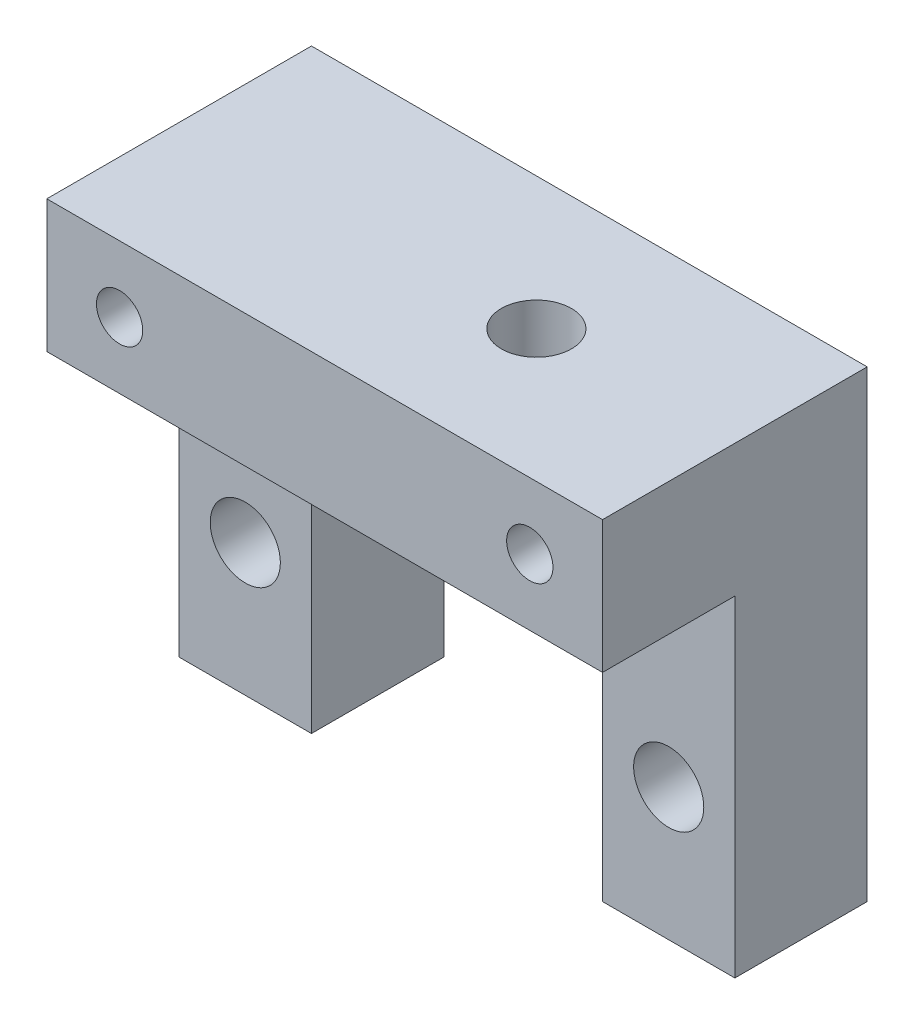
ISO-10303-21;
HEADER;
FILE_DESCRIPTION(('STEP AP214'),'2;1');
FILE_NAME('part.step','',(''),(''),'','','');
FILE_SCHEMA(('AUTOMOTIVE_DESIGN { 1 0 10303 214 1 1 1 1 }'));
ENDSEC;
DATA;
#1=APPLICATION_CONTEXT('core data for automotive mechanical design processes');
#2=APPLICATION_PROTOCOL_DEFINITION('international standard','automotive_design',2000,#1);
#3=PRODUCT_CONTEXT('',#1,'mechanical');
#4=PRODUCT('Part','Part','',(#3));
#5=PRODUCT_RELATED_PRODUCT_CATEGORY('part','',(#4));
#6=PRODUCT_DEFINITION_FORMATION('','',#4);
#7=PRODUCT_DEFINITION_CONTEXT('part definition',#1,'design');
#8=PRODUCT_DEFINITION('design','',#6,#7);
#9=PRODUCT_DEFINITION_SHAPE('','',#8);
#10=(LENGTH_UNIT() NAMED_UNIT(*) SI_UNIT(.MILLI.,.METRE.));
#11=(NAMED_UNIT(*) PLANE_ANGLE_UNIT() SI_UNIT($,.RADIAN.));
#12=(NAMED_UNIT(*) SI_UNIT($,.STERADIAN.) SOLID_ANGLE_UNIT());
#13=UNCERTAINTY_MEASURE_WITH_UNIT(LENGTH_MEASURE(1.E-05),#10,'distance_accuracy_value','');
#14=(GEOMETRIC_REPRESENTATION_CONTEXT(3) GLOBAL_UNCERTAINTY_ASSIGNED_CONTEXT((#13)) GLOBAL_UNIT_ASSIGNED_CONTEXT((#10,
#11,#12)) REPRESENTATION_CONTEXT('',''));
#15=CARTESIAN_POINT('',(0.,0.,0.));
#16=DIRECTION('',(0.,0.,1.));
#17=DIRECTION('',(1.,0.,0.));
#18=AXIS2_PLACEMENT_3D('',#15,#16,#17);
#19=CARTESIAN_POINT('',(0.,0.,0.));
#20=DIRECTION('',(0.,1.,0.));
#21=DIRECTION('',(0.,0.,1.));
#22=AXIS2_PLACEMENT_3D('',#19,#20,#21);
#23=PLANE('',#22);
#24=CARTESIAN_POINT('',(6.,0.,-0.550658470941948));
#25=DIRECTION('',(0.,1.,0.));
#26=DIRECTION('',(0.,0.,1.));
#27=AXIS2_PLACEMENT_3D('',#24,#25,#26);
#28=CIRCLE('',#27,2.65);
#29=CARTESIAN_POINT('',(6.,0.,2.09934152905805));
#30=VERTEX_POINT('',#29);
#31=EDGE_CURVE('E172',#30,#30,#28,.T.);
#32=ORIENTED_EDGE('',*,*,#31,.T.);
#33=EDGE_LOOP('',(#32));
#34=FACE_BOUND('',#33,.T.);
#35=DIRECTION('',(0.,0.,1.));
#36=VECTOR('',#35,1.);
#37=CARTESIAN_POINT('',(-11.,0.,-0.550658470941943));
#38=LINE('',#37,#36);
#39=CARTESIAN_POINT('',(-11.,0.,-10.5506584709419));
#40=VERTEX_POINT('',#39);
#41=CARTESIAN_POINT('',(-11.,0.,-0.550658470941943));
#42=VERTEX_POINT('',#41);
#43=EDGE_CURVE('E250',#40,#42,#38,.T.);
#44=ORIENTED_EDGE('',*,*,#43,.F.);
#45=DIRECTION('',(-1.,0.,0.));
#46=VECTOR('',#45,1.);
#47=CARTESIAN_POINT('',(21.,0.,-10.5506584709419));
#48=LINE('',#47,#46);
#49=CARTESIAN_POINT('',(11.,0.,-10.5506584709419));
#50=VERTEX_POINT('',#49);
#51=EDGE_CURVE('E55',#50,#40,#48,.T.);
#52=ORIENTED_EDGE('',*,*,#51,.F.);
#53=DIRECTION('',(0.,0.,-1.));
#54=VECTOR('',#53,1.);
#55=CARTESIAN_POINT('',(11.,0.,-0.550658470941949));
#56=LINE('',#55,#54);
#57=CARTESIAN_POINT('',(11.,0.,-0.550658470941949));
#58=VERTEX_POINT('',#57);
#59=EDGE_CURVE('E135',#58,#50,#56,.T.);
#60=ORIENTED_EDGE('',*,*,#59,.F.);
#61=DIRECTION('',(-1.,0.,0.));
#62=VECTOR('',#61,1.);
#63=CARTESIAN_POINT('',(21.,0.,-0.550658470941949));
#64=LINE('',#63,#62);
#65=CARTESIAN_POINT('',(21.,0.,-0.550658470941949));
#66=VERTEX_POINT('',#65);
#67=EDGE_CURVE('E49',#66,#58,#64,.T.);
#68=ORIENTED_EDGE('',*,*,#67,.F.);
#69=DIRECTION('',(0.,0.,-1.));
#70=VECTOR('',#69,1.);
#71=CARTESIAN_POINT('',(21.,0.,9.44934152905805));
#72=LINE('',#71,#70);
#73=CARTESIAN_POINT('',(21.,0.,9.44934152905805));
#74=VERTEX_POINT('',#73);
#75=EDGE_CURVE('E177',#74,#66,#72,.T.);
#76=ORIENTED_EDGE('',*,*,#75,.F.);
#77=DIRECTION('',(1.,0.,0.));
#78=VECTOR('',#77,1.);
#79=CARTESIAN_POINT('',(21.,0.,9.44934152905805));
#80=LINE('',#79,#78);
#81=CARTESIAN_POINT('',(-21.,0.,9.44934152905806));
#82=VERTEX_POINT('',#81);
#83=EDGE_CURVE('E180',#82,#74,#80,.T.);
#84=ORIENTED_EDGE('',*,*,#83,.F.);
#85=DIRECTION('',(0.,0.,1.));
#86=VECTOR('',#85,1.);
#87=CARTESIAN_POINT('',(-21.,0.,9.44934152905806));
#88=LINE('',#87,#86);
#89=CARTESIAN_POINT('',(-21.,0.,-0.550658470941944));
#90=VERTEX_POINT('',#89);
#91=EDGE_CURVE('E203',#90,#82,#88,.T.);
#92=ORIENTED_EDGE('',*,*,#91,.F.);
#93=DIRECTION('',(-1.,0.,0.));
#94=VECTOR('',#93,1.);
#95=CARTESIAN_POINT('',(-21.,0.,-0.550658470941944));
#96=LINE('',#95,#94);
#97=EDGE_CURVE('E130',#42,#90,#96,.T.);
#98=ORIENTED_EDGE('',*,*,#97,.F.);
#99=EDGE_LOOP('',(#44,#52,#60,#68,#76,#84,#92,#98));
#100=FACE_BOUND('',#99,.T.);
#101=ADVANCED_FACE('F32',(#34,#100),#23,.F.);
#102=CARTESIAN_POINT('',(-21.,10.,9.44934152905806));
#103=DIRECTION('',(1.,0.,0.));
#104=DIRECTION('',(0.,0.,-1.));
#105=AXIS2_PLACEMENT_3D('',#102,#103,#104);
#106=PLANE('',#105);
#107=DIRECTION('',(0.,-1.,0.));
#108=VECTOR('',#107,1.);
#109=CARTESIAN_POINT('',(-21.,10.,-10.5506584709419));
#110=LINE('',#109,#108);
#111=CARTESIAN_POINT('',(-21.,10.,-10.5506584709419));
#112=VERTEX_POINT('',#111);
#113=CARTESIAN_POINT('',(-21.,-25.,-10.5506584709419));
#114=VERTEX_POINT('',#113);
#115=EDGE_CURVE('E187',#112,#114,#110,.T.);
#116=ORIENTED_EDGE('',*,*,#115,.T.);
#117=DIRECTION('',(0.,0.,-1.));
#118=VECTOR('',#117,1.);
#119=CARTESIAN_POINT('',(-21.,-25.,-10.5506584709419));
#120=LINE('',#119,#118);
#121=CARTESIAN_POINT('',(-21.,-25.,-0.550658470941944));
#122=VERTEX_POINT('',#121);
#123=EDGE_CURVE('E127',#122,#114,#120,.T.);
#124=ORIENTED_EDGE('',*,*,#123,.F.);
#125=DIRECTION('',(0.,1.,0.));
#126=VECTOR('',#125,1.);
#127=CARTESIAN_POINT('',(-21.,-25.,-0.550658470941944));
#128=LINE('',#127,#126);
#129=EDGE_CURVE('E137',#122,#90,#128,.T.);
#130=ORIENTED_EDGE('',*,*,#129,.T.);
#131=ORIENTED_EDGE('',*,*,#91,.T.);
#132=DIRECTION('',(0.,-1.,0.));
#133=VECTOR('',#132,1.);
#134=CARTESIAN_POINT('',(-21.,10.,9.44934152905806));
#135=LINE('',#134,#133);
#136=CARTESIAN_POINT('',(-21.,10.,9.44934152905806));
#137=VERTEX_POINT('',#136);
#138=EDGE_CURVE('E11',#137,#82,#135,.T.);
#139=ORIENTED_EDGE('',*,*,#138,.F.);
#140=DIRECTION('',(0.,0.,1.));
#141=VECTOR('',#140,1.);
#142=CARTESIAN_POINT('',(-21.,10.,9.44934152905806));
#143=LINE('',#142,#141);
#144=EDGE_CURVE('E210',#112,#137,#143,.T.);
#145=ORIENTED_EDGE('',*,*,#144,.F.);
#146=EDGE_LOOP('',(#116,#124,#130,#131,#139,#145));
#147=FACE_BOUND('',#146,.T.);
#148=ADVANCED_FACE('F34',(#147),#106,.F.);
#149=CARTESIAN_POINT('',(21.,10.,9.44934152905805));
#150=DIRECTION('',(0.,0.,-1.));
#151=DIRECTION('',(-1.,0.,0.));
#152=AXIS2_PLACEMENT_3D('',#149,#150,#151);
#153=PLANE('',#152);
#154=CARTESIAN_POINT('',(15.5,5.,9.44934152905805));
#155=DIRECTION('',(0.,0.,1.));
#156=DIRECTION('',(1.,0.,0.));
#157=AXIS2_PLACEMENT_3D('',#154,#155,#156);
#158=CIRCLE('',#157,1.75);
#159=CARTESIAN_POINT('',(17.25,5.,9.44934152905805));
#160=VERTEX_POINT('',#159);
#161=EDGE_CURVE('E225',#160,#160,#158,.T.);
#162=ORIENTED_EDGE('',*,*,#161,.F.);
#163=EDGE_LOOP('',(#162));
#164=FACE_BOUND('',#163,.T.);
#165=CARTESIAN_POINT('',(-15.5,4.99999999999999,9.44934152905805));
#166=DIRECTION('',(0.,0.,1.));
#167=DIRECTION('',(1.,0.,0.));
#168=AXIS2_PLACEMENT_3D('',#165,#166,#167);
#169=CIRCLE('',#168,1.75);
#170=CARTESIAN_POINT('',(-13.75,4.99999999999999,9.44934152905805));
#171=VERTEX_POINT('',#170);
#172=EDGE_CURVE('E215',#171,#171,#169,.T.);
#173=ORIENTED_EDGE('',*,*,#172,.F.);
#174=EDGE_LOOP('',(#173));
#175=FACE_BOUND('',#174,.T.);
#176=ORIENTED_EDGE('',*,*,#83,.T.);
#177=DIRECTION('',(0.,-1.,0.));
#178=VECTOR('',#177,1.);
#179=CARTESIAN_POINT('',(21.,10.,9.44934152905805));
#180=LINE('',#179,#178);
#181=CARTESIAN_POINT('',(21.,10.,9.44934152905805));
#182=VERTEX_POINT('',#181);
#183=EDGE_CURVE('E41',#182,#74,#180,.T.);
#184=ORIENTED_EDGE('',*,*,#183,.F.);
#185=DIRECTION('',(1.,0.,0.));
#186=VECTOR('',#185,1.);
#187=CARTESIAN_POINT('',(21.,10.,9.44934152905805));
#188=LINE('',#187,#186);
#189=EDGE_CURVE('E206',#137,#182,#188,.T.);
#190=ORIENTED_EDGE('',*,*,#189,.F.);
#191=ORIENTED_EDGE('',*,*,#138,.T.);
#192=EDGE_LOOP('',(#176,#184,#190,#191));
#193=FACE_BOUND('',#192,.T.);
#194=ADVANCED_FACE('F205',(#164,#175,#193),#153,.F.);
#195=CARTESIAN_POINT('',(21.,10.,9.44934152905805));
#196=DIRECTION('',(-1.,0.,0.));
#197=DIRECTION('',(0.,0.,1.));
#198=AXIS2_PLACEMENT_3D('',#195,#196,#197);
#199=PLANE('',#198);
#200=ORIENTED_EDGE('',*,*,#75,.T.);
#201=DIRECTION('',(0.,1.,0.));
#202=VECTOR('',#201,1.);
#203=CARTESIAN_POINT('',(21.,-25.,-0.550658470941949));
#204=LINE('',#203,#202);
#205=CARTESIAN_POINT('',(21.,-25.,-0.550658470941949));
#206=VERTEX_POINT('',#205);
#207=EDGE_CURVE('E163',#206,#66,#204,.T.);
#208=ORIENTED_EDGE('',*,*,#207,.F.);
#209=DIRECTION('',(0.,0.,1.));
#210=VECTOR('',#209,1.);
#211=CARTESIAN_POINT('',(21.,-25.,-10.5506584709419));
#212=LINE('',#211,#210);
#213=CARTESIAN_POINT('',(21.,-25.,-10.5506584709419));
#214=VERTEX_POINT('',#213);
#215=EDGE_CURVE('E141',#214,#206,#212,.T.);
#216=ORIENTED_EDGE('',*,*,#215,.F.);
#217=DIRECTION('',(0.,-1.,0.));
#218=VECTOR('',#217,1.);
#219=CARTESIAN_POINT('',(21.,10.,-10.5506584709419));
#220=LINE('',#219,#218);
#221=CARTESIAN_POINT('',(21.,10.,-10.5506584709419));
#222=VERTEX_POINT('',#221);
#223=EDGE_CURVE('E189',#222,#214,#220,.T.);
#224=ORIENTED_EDGE('',*,*,#223,.F.);
#225=DIRECTION('',(0.,0.,-1.));
#226=VECTOR('',#225,1.);
#227=CARTESIAN_POINT('',(21.,10.,9.44934152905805));
#228=LINE('',#227,#226);
#229=EDGE_CURVE('E198',#182,#222,#228,.T.);
#230=ORIENTED_EDGE('',*,*,#229,.F.);
#231=ORIENTED_EDGE('',*,*,#183,.T.);
#232=EDGE_LOOP('',(#200,#208,#216,#224,#230,#231));
#233=FACE_BOUND('',#232,.T.);
#234=ADVANCED_FACE('F196',(#233),#199,.F.);
#235=CARTESIAN_POINT('',(21.,10.,-10.5506584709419));
#236=DIRECTION('',(0.,0.,1.));
#237=DIRECTION('',(1.,0.,0.));
#238=AXIS2_PLACEMENT_3D('',#235,#236,#237);
#239=PLANE('',#238);
#240=CARTESIAN_POINT('',(-16.,-15.,-10.5506584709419));
#241=DIRECTION('',(0.,0.,1.));
#242=DIRECTION('',(1.,0.,0.));
#243=AXIS2_PLACEMENT_3D('',#240,#241,#242);
#244=CIRCLE('',#243,2.65);
#245=CARTESIAN_POINT('',(-13.35,-15.,-10.5506584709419));
#246=VERTEX_POINT('',#245);
#247=EDGE_CURVE('E362',#246,#246,#244,.T.);
#248=ORIENTED_EDGE('',*,*,#247,.T.);
#249=EDGE_LOOP('',(#248));
#250=FACE_BOUND('',#249,.T.);
#251=CARTESIAN_POINT('',(16.,-15.,-10.5506584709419));
#252=DIRECTION('',(0.,0.,1.));
#253=DIRECTION('',(1.,0.,0.));
#254=AXIS2_PLACEMENT_3D('',#251,#252,#253);
#255=CIRCLE('',#254,2.65);
#256=CARTESIAN_POINT('',(18.65,-15.,-10.5506584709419));
#257=VERTEX_POINT('',#256);
#258=EDGE_CURVE('E252',#257,#257,#255,.T.);
#259=ORIENTED_EDGE('',*,*,#258,.T.);
#260=EDGE_LOOP('',(#259));
#261=FACE_BOUND('',#260,.T.);
#262=CARTESIAN_POINT('',(15.5,5.,-10.5506584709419));
#263=DIRECTION('',(0.,0.,1.));
#264=DIRECTION('',(1.,0.,0.));
#265=AXIS2_PLACEMENT_3D('',#262,#263,#264);
#266=CIRCLE('',#265,1.75);
#267=CARTESIAN_POINT('',(17.25,5.,-10.5506584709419));
#268=VERTEX_POINT('',#267);
#269=EDGE_CURVE('E223',#268,#268,#266,.T.);
#270=ORIENTED_EDGE('',*,*,#269,.T.);
#271=EDGE_LOOP('',(#270));
#272=FACE_BOUND('',#271,.T.);
#273=CARTESIAN_POINT('',(-15.5,4.99999999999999,-10.5506584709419));
#274=DIRECTION('',(0.,0.,1.));
#275=DIRECTION('',(1.,0.,0.));
#276=AXIS2_PLACEMENT_3D('',#273,#274,#275);
#277=CIRCLE('',#276,1.75);
#278=CARTESIAN_POINT('',(-13.75,4.99999999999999,-10.5506584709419));
#279=VERTEX_POINT('',#278);
#280=EDGE_CURVE('E213',#279,#279,#277,.T.);
#281=ORIENTED_EDGE('',*,*,#280,.T.);
#282=EDGE_LOOP('',(#281));
#283=FACE_BOUND('',#282,.T.);
#284=ORIENTED_EDGE('',*,*,#223,.T.);
#285=DIRECTION('',(1.,0.,0.));
#286=VECTOR('',#285,1.);
#287=CARTESIAN_POINT('',(11.,-25.,-10.5506584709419));
#288=LINE('',#287,#286);
#289=CARTESIAN_POINT('',(11.,-25.,-10.5506584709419));
#290=VERTEX_POINT('',#289);
#291=EDGE_CURVE('E148',#290,#214,#288,.T.);
#292=ORIENTED_EDGE('',*,*,#291,.F.);
#293=DIRECTION('',(0.,1.,0.));
#294=VECTOR('',#293,1.);
#295=CARTESIAN_POINT('',(11.,-25.,-10.5506584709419));
#296=LINE('',#295,#294);
#297=EDGE_CURVE('E151',#290,#50,#296,.T.);
#298=ORIENTED_EDGE('',*,*,#297,.T.);
#299=ORIENTED_EDGE('',*,*,#51,.T.);
#300=DIRECTION('',(0.,1.,0.));
#301=VECTOR('',#300,1.);
#302=CARTESIAN_POINT('',(-11.,-25.,-10.5506584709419));
#303=LINE('',#302,#301);
#304=CARTESIAN_POINT('',(-11.,-25.,-10.5506584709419));
#305=VERTEX_POINT('',#304);
#306=EDGE_CURVE('E115',#305,#40,#303,.T.);
#307=ORIENTED_EDGE('',*,*,#306,.F.);
#308=DIRECTION('',(1.,0.,0.));
#309=VECTOR('',#308,1.);
#310=CARTESIAN_POINT('',(-11.,-25.,-10.5506584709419));
#311=LINE('',#310,#309);
#312=EDGE_CURVE('E121',#114,#305,#311,.T.);
#313=ORIENTED_EDGE('',*,*,#312,.F.);
#314=ORIENTED_EDGE('',*,*,#115,.F.);
#315=DIRECTION('',(-1.,0.,0.));
#316=VECTOR('',#315,1.);
#317=CARTESIAN_POINT('',(21.,10.,-10.5506584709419));
#318=LINE('',#317,#316);
#319=EDGE_CURVE('E190',#222,#112,#318,.T.);
#320=ORIENTED_EDGE('',*,*,#319,.F.);
#321=EDGE_LOOP('',(#284,#292,#298,#299,#307,#313,#314,#320));
#322=FACE_BOUND('',#321,.T.);
#323=ADVANCED_FACE('F132',(#250,#261,#272,#283,#322),#239,.F.);
#324=CARTESIAN_POINT('',(0.,10.,0.));
#325=DIRECTION('',(0.,1.,0.));
#326=DIRECTION('',(0.,0.,1.));
#327=AXIS2_PLACEMENT_3D('',#324,#325,#326);
#328=PLANE('',#327);
#329=CARTESIAN_POINT('',(6.,10.,-0.550658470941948));
#330=DIRECTION('',(0.,1.,0.));
#331=DIRECTION('',(0.,0.,1.));
#332=AXIS2_PLACEMENT_3D('',#329,#330,#331);
#333=CIRCLE('',#332,2.65);
#334=CARTESIAN_POINT('',(6.,10.,2.09934152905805));
#335=VERTEX_POINT('',#334);
#336=EDGE_CURVE('E168',#335,#335,#333,.T.);
#337=ORIENTED_EDGE('',*,*,#336,.F.);
#338=EDGE_LOOP('',(#337));
#339=FACE_BOUND('',#338,.T.);
#340=ORIENTED_EDGE('',*,*,#144,.T.);
#341=ORIENTED_EDGE('',*,*,#189,.T.);
#342=ORIENTED_EDGE('',*,*,#229,.T.);
#343=ORIENTED_EDGE('',*,*,#319,.T.);
#344=EDGE_LOOP('',(#340,#341,#342,#343));
#345=FACE_BOUND('',#344,.T.);
#346=ADVANCED_FACE('F241',(#339,#345),#328,.T.);
#347=CARTESIAN_POINT('',(-15.5,4.99999999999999,-10.5506584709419));
#348=DIRECTION('',(0.,0.,1.));
#349=DIRECTION('',(1.,0.,0.));
#350=AXIS2_PLACEMENT_3D('',#347,#348,#349);
#351=CYLINDRICAL_SURFACE('',#350,1.75);
#352=ORIENTED_EDGE('',*,*,#280,.F.);
#353=EDGE_LOOP('',(#352));
#354=FACE_BOUND('',#353,.T.);
#355=ORIENTED_EDGE('',*,*,#172,.T.);
#356=EDGE_LOOP('',(#355));
#357=FACE_BOUND('',#356,.T.);
#358=ADVANCED_FACE('F244',(#354,#357),#351,.F.);
#359=CARTESIAN_POINT('',(15.5,5.,-10.5506584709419));
#360=DIRECTION('',(0.,0.,1.));
#361=DIRECTION('',(1.,0.,0.));
#362=AXIS2_PLACEMENT_3D('',#359,#360,#361);
#363=CYLINDRICAL_SURFACE('',#362,1.75);
#364=ORIENTED_EDGE('',*,*,#269,.F.);
#365=EDGE_LOOP('',(#364));
#366=FACE_BOUND('',#365,.T.);
#367=ORIENTED_EDGE('',*,*,#161,.T.);
#368=EDGE_LOOP('',(#367));
#369=FACE_BOUND('',#368,.T.);
#370=ADVANCED_FACE('F237',(#366,#369),#363,.F.);
#371=CARTESIAN_POINT('',(6.,0.,-0.550658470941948));
#372=DIRECTION('',(0.,1.,0.));
#373=DIRECTION('',(0.,0.,1.));
#374=AXIS2_PLACEMENT_3D('',#371,#372,#373);
#375=CYLINDRICAL_SURFACE('',#374,2.65);
#376=ORIENTED_EDGE('',*,*,#31,.F.);
#377=EDGE_LOOP('',(#376));
#378=FACE_BOUND('',#377,.T.);
#379=ORIENTED_EDGE('',*,*,#336,.T.);
#380=EDGE_LOOP('',(#379));
#381=FACE_BOUND('',#380,.T.);
#382=ADVANCED_FACE('F233',(#378,#381),#375,.F.);
#383=CARTESIAN_POINT('',(21.,-25.,-0.550658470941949));
#384=DIRECTION('',(0.,0.,-1.));
#385=DIRECTION('',(-1.,0.,0.));
#386=AXIS2_PLACEMENT_3D('',#383,#384,#385);
#387=PLANE('',#386);
#388=CARTESIAN_POINT('',(16.,-15.,-0.550658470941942));
#389=DIRECTION('',(0.,0.,1.));
#390=DIRECTION('',(1.,0.,0.));
#391=AXIS2_PLACEMENT_3D('',#388,#389,#390);
#392=CIRCLE('',#391,2.65);
#393=CARTESIAN_POINT('',(18.65,-15.,-0.550658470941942));
#394=VERTEX_POINT('',#393);
#395=EDGE_CURVE('E366',#394,#394,#392,.T.);
#396=ORIENTED_EDGE('',*,*,#395,.F.);
#397=EDGE_LOOP('',(#396));
#398=FACE_BOUND('',#397,.T.);
#399=ORIENTED_EDGE('',*,*,#67,.T.);
#400=DIRECTION('',(0.,1.,0.));
#401=VECTOR('',#400,1.);
#402=CARTESIAN_POINT('',(11.,-25.,-0.550658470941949));
#403=LINE('',#402,#401);
#404=CARTESIAN_POINT('',(11.,-25.,-0.550658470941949));
#405=VERTEX_POINT('',#404);
#406=EDGE_CURVE('E154',#405,#58,#403,.T.);
#407=ORIENTED_EDGE('',*,*,#406,.F.);
#408=DIRECTION('',(-1.,0.,0.));
#409=VECTOR('',#408,1.);
#410=CARTESIAN_POINT('',(21.,-25.,-0.550658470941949));
#411=LINE('',#410,#409);
#412=EDGE_CURVE('E144',#206,#405,#411,.T.);
#413=ORIENTED_EDGE('',*,*,#412,.F.);
#414=ORIENTED_EDGE('',*,*,#207,.T.);
#415=EDGE_LOOP('',(#399,#407,#413,#414));
#416=FACE_BOUND('',#415,.T.);
#417=ADVANCED_FACE('F236',(#398,#416),#387,.F.);
#418=CARTESIAN_POINT('',(11.,-25.,-0.550658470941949));
#419=DIRECTION('',(1.,0.,0.));
#420=DIRECTION('',(0.,0.,-1.));
#421=AXIS2_PLACEMENT_3D('',#418,#419,#420);
#422=PLANE('',#421);
#423=ORIENTED_EDGE('',*,*,#59,.T.);
#424=ORIENTED_EDGE('',*,*,#297,.F.);
#425=DIRECTION('',(0.,0.,-1.));
#426=VECTOR('',#425,1.);
#427=CARTESIAN_POINT('',(11.,-25.,-0.550658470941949));
#428=LINE('',#427,#426);
#429=EDGE_CURVE('E146',#405,#290,#428,.T.);
#430=ORIENTED_EDGE('',*,*,#429,.F.);
#431=ORIENTED_EDGE('',*,*,#406,.T.);
#432=EDGE_LOOP('',(#423,#424,#430,#431));
#433=FACE_BOUND('',#432,.T.);
#434=ADVANCED_FACE('F297',(#433),#422,.F.);
#435=CARTESIAN_POINT('',(0.,-25.,0.));
#436=DIRECTION('',(0.,-1.,0.));
#437=DIRECTION('',(0.,0.,-1.));
#438=AXIS2_PLACEMENT_3D('',#435,#436,#437);
#439=PLANE('',#438);
#440=ORIENTED_EDGE('',*,*,#215,.T.);
#441=ORIENTED_EDGE('',*,*,#412,.T.);
#442=ORIENTED_EDGE('',*,*,#429,.T.);
#443=ORIENTED_EDGE('',*,*,#291,.T.);
#444=EDGE_LOOP('',(#440,#441,#442,#443));
#445=FACE_BOUND('',#444,.T.);
#446=ADVANCED_FACE('F264',(#445),#439,.T.);
#447=CARTESIAN_POINT('',(-11.,-25.,-0.550658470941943));
#448=DIRECTION('',(-1.,0.,0.));
#449=DIRECTION('',(0.,0.,1.));
#450=AXIS2_PLACEMENT_3D('',#447,#448,#449);
#451=PLANE('',#450);
#452=ORIENTED_EDGE('',*,*,#43,.T.);
#453=DIRECTION('',(0.,1.,0.));
#454=VECTOR('',#453,1.);
#455=CARTESIAN_POINT('',(-11.,-25.,-0.550658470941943));
#456=LINE('',#455,#454);
#457=CARTESIAN_POINT('',(-11.,-25.,-0.550658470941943));
#458=VERTEX_POINT('',#457);
#459=EDGE_CURVE('E117',#458,#42,#456,.T.);
#460=ORIENTED_EDGE('',*,*,#459,.F.);
#461=DIRECTION('',(0.,0.,1.));
#462=VECTOR('',#461,1.);
#463=CARTESIAN_POINT('',(-11.,-25.,-0.550658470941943));
#464=LINE('',#463,#462);
#465=EDGE_CURVE('E111',#305,#458,#464,.T.);
#466=ORIENTED_EDGE('',*,*,#465,.F.);
#467=ORIENTED_EDGE('',*,*,#306,.T.);
#468=EDGE_LOOP('',(#452,#460,#466,#467));
#469=FACE_BOUND('',#468,.T.);
#470=ADVANCED_FACE('F113',(#469),#451,.F.);
#471=CARTESIAN_POINT('',(-21.,-25.,-0.550658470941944));
#472=DIRECTION('',(0.,0.,-1.));
#473=DIRECTION('',(-1.,0.,0.));
#474=AXIS2_PLACEMENT_3D('',#471,#472,#473);
#475=PLANE('',#474);
#476=CARTESIAN_POINT('',(-16.,-15.,-0.550658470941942));
#477=DIRECTION('',(0.,0.,1.));
#478=DIRECTION('',(1.,0.,0.));
#479=AXIS2_PLACEMENT_3D('',#476,#477,#478);
#480=CIRCLE('',#479,2.65);
#481=CARTESIAN_POINT('',(-13.35,-15.,-0.550658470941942));
#482=VERTEX_POINT('',#481);
#483=EDGE_CURVE('E364',#482,#482,#480,.T.);
#484=ORIENTED_EDGE('',*,*,#483,.F.);
#485=EDGE_LOOP('',(#484));
#486=FACE_BOUND('',#485,.T.);
#487=ORIENTED_EDGE('',*,*,#97,.T.);
#488=ORIENTED_EDGE('',*,*,#129,.F.);
#489=DIRECTION('',(-1.,0.,0.));
#490=VECTOR('',#489,1.);
#491=CARTESIAN_POINT('',(-21.,-25.,-0.550658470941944));
#492=LINE('',#491,#490);
#493=EDGE_CURVE('E120',#458,#122,#492,.T.);
#494=ORIENTED_EDGE('',*,*,#493,.F.);
#495=ORIENTED_EDGE('',*,*,#459,.T.);
#496=EDGE_LOOP('',(#487,#488,#494,#495));
#497=FACE_BOUND('',#496,.T.);
#498=ADVANCED_FACE('F254',(#486,#497),#475,.F.);
#499=CARTESIAN_POINT('',(0.,-25.,0.));
#500=DIRECTION('',(0.,1.,0.));
#501=DIRECTION('',(0.,0.,1.));
#502=AXIS2_PLACEMENT_3D('',#499,#500,#501);
#503=PLANE('',#502);
#504=ORIENTED_EDGE('',*,*,#312,.T.);
#505=ORIENTED_EDGE('',*,*,#465,.T.);
#506=ORIENTED_EDGE('',*,*,#493,.T.);
#507=ORIENTED_EDGE('',*,*,#123,.T.);
#508=EDGE_LOOP('',(#504,#505,#506,#507));
#509=FACE_BOUND('',#508,.T.);
#510=ADVANCED_FACE('F125',(#509),#503,.F.);
#511=CARTESIAN_POINT('',(16.,-15.,-10.5506584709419));
#512=DIRECTION('',(0.,0.,1.));
#513=DIRECTION('',(1.,0.,0.));
#514=AXIS2_PLACEMENT_3D('',#511,#512,#513);
#515=CYLINDRICAL_SURFACE('',#514,2.65);
#516=ORIENTED_EDGE('',*,*,#258,.F.);
#517=EDGE_LOOP('',(#516));
#518=FACE_BOUND('',#517,.T.);
#519=ORIENTED_EDGE('',*,*,#395,.T.);
#520=EDGE_LOOP('',(#519));
#521=FACE_BOUND('',#520,.T.);
#522=ADVANCED_FACE('F262',(#518,#521),#515,.F.);
#523=CARTESIAN_POINT('',(-16.,-15.,-10.5506584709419));
#524=DIRECTION('',(0.,0.,1.));
#525=DIRECTION('',(1.,0.,0.));
#526=AXIS2_PLACEMENT_3D('',#523,#524,#525);
#527=CYLINDRICAL_SURFACE('',#526,2.65);
#528=ORIENTED_EDGE('',*,*,#247,.F.);
#529=EDGE_LOOP('',(#528));
#530=FACE_BOUND('',#529,.T.);
#531=ORIENTED_EDGE('',*,*,#483,.T.);
#532=EDGE_LOOP('',(#531));
#533=FACE_BOUND('',#532,.T.);
#534=ADVANCED_FACE('F345',(#530,#533),#527,.F.);
#535=CLOSED_SHELL('',(#101,#148,#194,#234,#323,#346,#358,#370,#382,#417,#434,#446,#470,#498,
#510,#522,#534));
#536=MANIFOLD_SOLID_BREP('B2',#535);
#537=ADVANCED_BREP_SHAPE_REPRESENTATION('',(#18,#536),#14);
#538=SHAPE_DEFINITION_REPRESENTATION(#9,#537);
ENDSEC;
END-ISO-10303-21;
